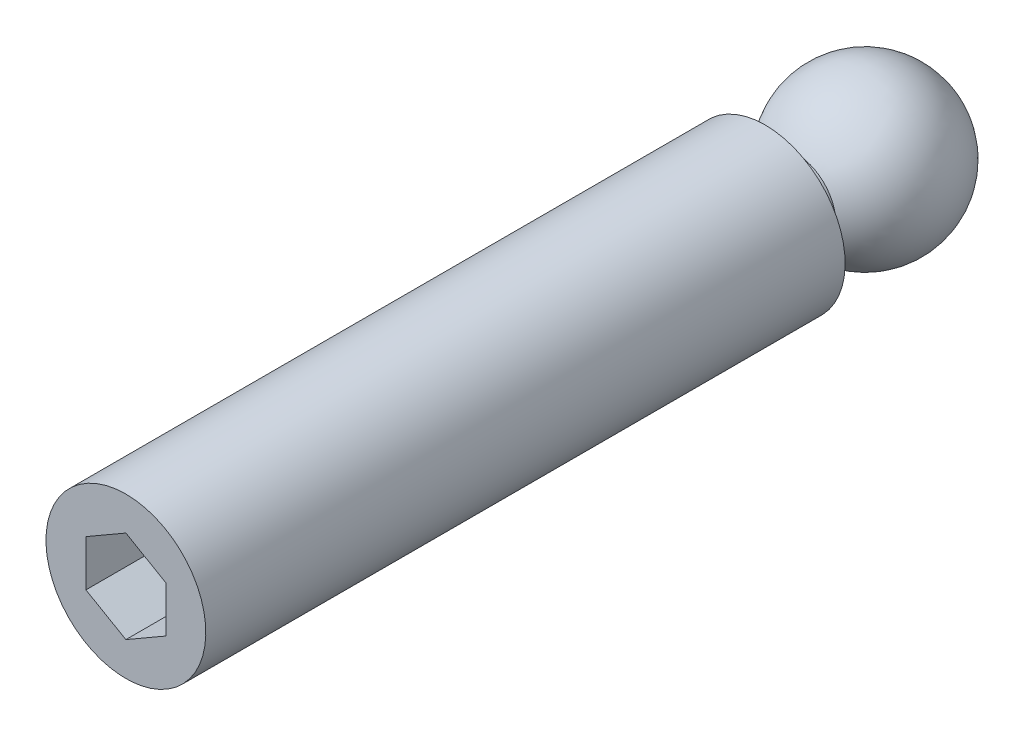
ISO-10303-21;
HEADER;
FILE_DESCRIPTION(('STEP AP214'),'2;1');
FILE_NAME('part.step','',(''),(''),'','','');
FILE_SCHEMA(('AUTOMOTIVE_DESIGN { 1 0 10303 214 1 1 1 1 }'));
ENDSEC;
DATA;
#1=APPLICATION_CONTEXT('core data for automotive mechanical design processes');
#2=APPLICATION_PROTOCOL_DEFINITION('international standard','automotive_design',2000,#1);
#3=PRODUCT_CONTEXT('',#1,'mechanical');
#4=PRODUCT('Part','Part','',(#3));
#5=PRODUCT_RELATED_PRODUCT_CATEGORY('part','',(#4));
#6=PRODUCT_DEFINITION_FORMATION('','',#4);
#7=PRODUCT_DEFINITION_CONTEXT('part definition',#1,'design');
#8=PRODUCT_DEFINITION('design','',#6,#7);
#9=PRODUCT_DEFINITION_SHAPE('','',#8);
#10=(LENGTH_UNIT() NAMED_UNIT(*) SI_UNIT(.MILLI.,.METRE.));
#11=(NAMED_UNIT(*) PLANE_ANGLE_UNIT() SI_UNIT($,.RADIAN.));
#12=(NAMED_UNIT(*) SI_UNIT($,.STERADIAN.) SOLID_ANGLE_UNIT());
#13=UNCERTAINTY_MEASURE_WITH_UNIT(LENGTH_MEASURE(1.E-05),#10,'distance_accuracy_value','');
#14=(GEOMETRIC_REPRESENTATION_CONTEXT(3) GLOBAL_UNCERTAINTY_ASSIGNED_CONTEXT((#13)) GLOBAL_UNIT_ASSIGNED_CONTEXT((#10,
#11,#12)) REPRESENTATION_CONTEXT('',''));
#15=CARTESIAN_POINT('',(0.,0.,0.));
#16=DIRECTION('',(0.,0.,1.));
#17=DIRECTION('',(1.,0.,0.));
#18=AXIS2_PLACEMENT_3D('',#15,#16,#17);
#19=CARTESIAN_POINT('',(0.,0.,4.));
#20=DIRECTION('',(0.,-1.,0.));
#21=DIRECTION('',(-1.,0.,0.));
#22=AXIS2_PLACEMENT_3D('',#19,#20,#21);
#23=SPHERICAL_SURFACE('',#22,4.);
#24=CARTESIAN_POINT('',(0.,0.,4.));
#25=DIRECTION('',(0.,0.,1.));
#26=DIRECTION('',(0.,1.,0.));
#27=AXIS2_PLACEMENT_3D('',#24,#25,#26);
#28=SPHERICAL_SURFACE('',#27,4.);
#29=CARTESIAN_POINT('',(0.,0.,7.46410161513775));
#30=DIRECTION('',(0.,0.,1.));
#31=DIRECTION('',(0.,1.,0.));
#32=AXIS2_PLACEMENT_3D('',#29,#30,#31);
#33=CIRCLE('',#32,2.);
#34=CARTESIAN_POINT('',(0.,2.,7.46410161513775));
#35=VERTEX_POINT('',#34);
#36=EDGE_CURVE('E9',#35,#35,#33,.T.);
#37=ORIENTED_EDGE('',*,*,#36,.F.);
#38=EDGE_LOOP('',(#37));
#39=FACE_BOUND('',#38,.T.);
#40=ADVANCED_FACE('F14',(#39),#28,.T.);
#41=CARTESIAN_POINT('',(0.,0.,30.));
#42=DIRECTION('',(0.,0.,1.));
#43=DIRECTION('',(0.,1.,0.));
#44=AXIS2_PLACEMENT_3D('',#41,#42,#43);
#45=CYLINDRICAL_SURFACE('',#44,2.);
#46=ORIENTED_EDGE('',*,*,#36,.T.);
#47=EDGE_LOOP('',(#46));
#48=FACE_BOUND('',#47,.T.);
#49=CARTESIAN_POINT('',(0.,0.,9.));
#50=DIRECTION('',(0.,0.,1.));
#51=DIRECTION('',(0.,1.,0.));
#52=AXIS2_PLACEMENT_3D('',#49,#50,#51);
#53=CIRCLE('',#52,2.);
#54=CARTESIAN_POINT('',(0.,2.,9.));
#55=VERTEX_POINT('',#54);
#56=EDGE_CURVE('E21',#55,#55,#53,.T.);
#57=ORIENTED_EDGE('',*,*,#56,.F.);
#58=EDGE_LOOP('',(#57));
#59=FACE_BOUND('',#58,.T.);
#60=ADVANCED_FACE('F131',(#48,#59),#45,.T.);
#61=CARTESIAN_POINT('',(0.,-4.,9.));
#62=DIRECTION('',(0.,0.,-1.));
#63=DIRECTION('',(0.,-1.,0.));
#64=AXIS2_PLACEMENT_3D('',#61,#62,#63);
#65=PLANE('',#64);
#66=ORIENTED_EDGE('',*,*,#56,.T.);
#67=EDGE_LOOP('',(#66));
#68=FACE_BOUND('',#67,.T.);
#69=CARTESIAN_POINT('',(0.,0.,9.));
#70=DIRECTION('',(0.,0.,1.));
#71=DIRECTION('',(0.,1.,0.));
#72=AXIS2_PLACEMENT_3D('',#69,#70,#71);
#73=CIRCLE('',#72,4.);
#74=CARTESIAN_POINT('',(0.,4.,9.));
#75=VERTEX_POINT('',#74);
#76=EDGE_CURVE('E123',#75,#75,#73,.T.);
#77=ORIENTED_EDGE('',*,*,#76,.F.);
#78=EDGE_LOOP('',(#77));
#79=FACE_BOUND('',#78,.T.);
#80=ADVANCED_FACE('F128',(#68,#79),#65,.T.);
#81=CARTESIAN_POINT('',(0.,0.,30.));
#82=DIRECTION('',(0.,0.,1.));
#83=DIRECTION('',(0.,1.,0.));
#84=AXIS2_PLACEMENT_3D('',#81,#82,#83);
#85=CYLINDRICAL_SURFACE('',#84,4.);
#86=ORIENTED_EDGE('',*,*,#76,.T.);
#87=EDGE_LOOP('',(#86));
#88=FACE_BOUND('',#87,.T.);
#89=CARTESIAN_POINT('',(0.,0.,41.));
#90=DIRECTION('',(0.,0.,1.));
#91=DIRECTION('',(0.,1.,0.));
#92=AXIS2_PLACEMENT_3D('',#89,#90,#91);
#93=CIRCLE('',#92,4.);
#94=CARTESIAN_POINT('',(0.,4.,41.));
#95=VERTEX_POINT('',#94);
#96=EDGE_CURVE('E115',#95,#95,#93,.T.);
#97=ORIENTED_EDGE('',*,*,#96,.F.);
#98=EDGE_LOOP('',(#97));
#99=FACE_BOUND('',#98,.T.);
#100=ADVANCED_FACE('F139',(#88,#99),#85,.T.);
#101=CARTESIAN_POINT('',(0.,0.,41.));
#102=DIRECTION('',(0.,0.,1.));
#103=DIRECTION('',(0.,1.,0.));
#104=AXIS2_PLACEMENT_3D('',#101,#102,#103);
#105=PLANE('',#104);
#106=DIRECTION('',(-0.866025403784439,0.5,0.));
#107=VECTOR('',#106,1.);
#108=CARTESIAN_POINT('',(2.,1.15470053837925,41.));
#109=LINE('',#108,#107);
#110=CARTESIAN_POINT('',(2.,1.15470053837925,41.));
#111=VERTEX_POINT('',#110);
#112=CARTESIAN_POINT('',(0.,2.30940107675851,41.));
#113=VERTEX_POINT('',#112);
#114=EDGE_CURVE('E28',#111,#113,#109,.T.);
#115=ORIENTED_EDGE('',*,*,#114,.F.);
#116=DIRECTION('',(0.,1.,0.));
#117=VECTOR('',#116,1.);
#118=CARTESIAN_POINT('',(2.,-1.15470053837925,41.));
#119=LINE('',#118,#117);
#120=CARTESIAN_POINT('',(2.,-1.15470053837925,41.));
#121=VERTEX_POINT('',#120);
#122=EDGE_CURVE('E111',#121,#111,#119,.T.);
#123=ORIENTED_EDGE('',*,*,#122,.F.);
#124=DIRECTION('',(0.866025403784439,0.5,0.));
#125=VECTOR('',#124,1.);
#126=CARTESIAN_POINT('',(0.,-2.30940107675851,41.));
#127=LINE('',#126,#125);
#128=CARTESIAN_POINT('',(0.,-2.30940107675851,41.));
#129=VERTEX_POINT('',#128);
#130=EDGE_CURVE('E109',#129,#121,#127,.T.);
#131=ORIENTED_EDGE('',*,*,#130,.F.);
#132=DIRECTION('',(0.866025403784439,-0.5,0.));
#133=VECTOR('',#132,1.);
#134=CARTESIAN_POINT('',(-2.,-1.15470053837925,41.));
#135=LINE('',#134,#133);
#136=CARTESIAN_POINT('',(-2.,-1.15470053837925,41.));
#137=VERTEX_POINT('',#136);
#138=EDGE_CURVE('E76',#137,#129,#135,.T.);
#139=ORIENTED_EDGE('',*,*,#138,.F.);
#140=DIRECTION('',(0.,-1.,0.));
#141=VECTOR('',#140,1.);
#142=CARTESIAN_POINT('',(-2.,1.15470053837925,41.));
#143=LINE('',#142,#141);
#144=CARTESIAN_POINT('',(-2.,1.15470053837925,41.));
#145=VERTEX_POINT('',#144);
#146=EDGE_CURVE('E105',#145,#137,#143,.T.);
#147=ORIENTED_EDGE('',*,*,#146,.F.);
#148=DIRECTION('',(-0.866025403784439,-0.5,0.));
#149=VECTOR('',#148,1.);
#150=CARTESIAN_POINT('',(0.,2.30940107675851,41.));
#151=LINE('',#150,#149);
#152=EDGE_CURVE('E102',#113,#145,#151,.T.);
#153=ORIENTED_EDGE('',*,*,#152,.F.);
#154=EDGE_LOOP('',(#115,#123,#131,#139,#147,#153));
#155=FACE_BOUND('',#154,.T.);
#156=ORIENTED_EDGE('',*,*,#96,.T.);
#157=EDGE_LOOP('',(#156));
#158=FACE_BOUND('',#157,.T.);
#159=ADVANCED_FACE('F145',(#155,#158),#105,.T.);
#160=CARTESIAN_POINT('',(2.,1.15470053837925,36.));
#161=DIRECTION('',(0.5,0.866025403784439,0.));
#162=DIRECTION('',(-0.866025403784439,0.5,0.));
#163=AXIS2_PLACEMENT_3D('',#160,#161,#162);
#164=PLANE('',#163);
#165=ORIENTED_EDGE('',*,*,#114,.T.);
#166=DIRECTION('',(0.,0.,1.));
#167=VECTOR('',#166,1.);
#168=CARTESIAN_POINT('',(0.,2.30940107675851,36.));
#169=LINE('',#168,#167);
#170=CARTESIAN_POINT('',(0.,2.30940107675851,36.));
#171=VERTEX_POINT('',#170);
#172=EDGE_CURVE('E58',#171,#113,#169,.T.);
#173=ORIENTED_EDGE('',*,*,#172,.F.);
#174=DIRECTION('',(-0.866025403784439,0.5,0.));
#175=VECTOR('',#174,1.);
#176=CARTESIAN_POINT('',(2.,1.15470053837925,36.));
#177=LINE('',#176,#175);
#178=CARTESIAN_POINT('',(2.,1.15470053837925,36.));
#179=VERTEX_POINT('',#178);
#180=EDGE_CURVE('E113',#179,#171,#177,.T.);
#181=ORIENTED_EDGE('',*,*,#180,.F.);
#182=DIRECTION('',(0.,0.,1.));
#183=VECTOR('',#182,1.);
#184=CARTESIAN_POINT('',(2.,1.15470053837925,36.));
#185=LINE('',#184,#183);
#186=EDGE_CURVE('E36',#179,#111,#185,.T.);
#187=ORIENTED_EDGE('',*,*,#186,.T.);
#188=EDGE_LOOP('',(#165,#173,#181,#187));
#189=FACE_BOUND('',#188,.T.);
#190=ADVANCED_FACE('F149',(#189),#164,.F.);
#191=CARTESIAN_POINT('',(2.,-1.15470053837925,36.));
#192=DIRECTION('',(1.,0.,0.));
#193=DIRECTION('',(0.,0.,-1.));
#194=AXIS2_PLACEMENT_3D('',#191,#192,#193);
#195=PLANE('',#194);
#196=ORIENTED_EDGE('',*,*,#122,.T.);
#197=ORIENTED_EDGE('',*,*,#186,.F.);
#198=DIRECTION('',(0.,1.,0.));
#199=VECTOR('',#198,1.);
#200=CARTESIAN_POINT('',(2.,-1.15470053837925,36.));
#201=LINE('',#200,#199);
#202=CARTESIAN_POINT('',(2.,-1.15470053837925,36.));
#203=VERTEX_POINT('',#202);
#204=EDGE_CURVE('E88',#203,#179,#201,.T.);
#205=ORIENTED_EDGE('',*,*,#204,.F.);
#206=DIRECTION('',(0.,0.,1.));
#207=VECTOR('',#206,1.);
#208=CARTESIAN_POINT('',(2.,-1.15470053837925,36.));
#209=LINE('',#208,#207);
#210=EDGE_CURVE('E80',#203,#121,#209,.T.);
#211=ORIENTED_EDGE('',*,*,#210,.T.);
#212=EDGE_LOOP('',(#196,#197,#205,#211));
#213=FACE_BOUND('',#212,.T.);
#214=ADVANCED_FACE('F153',(#213),#195,.F.);
#215=CARTESIAN_POINT('',(0.,-2.30940107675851,36.));
#216=DIRECTION('',(0.5,-0.866025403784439,0.));
#217=DIRECTION('',(0.866025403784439,0.5,0.));
#218=AXIS2_PLACEMENT_3D('',#215,#216,#217);
#219=PLANE('',#218);
#220=ORIENTED_EDGE('',*,*,#130,.T.);
#221=ORIENTED_EDGE('',*,*,#210,.F.);
#222=DIRECTION('',(0.866025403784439,0.5,0.));
#223=VECTOR('',#222,1.);
#224=CARTESIAN_POINT('',(0.,-2.30940107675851,36.));
#225=LINE('',#224,#223);
#226=CARTESIAN_POINT('',(0.,-2.30940107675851,36.));
#227=VERTEX_POINT('',#226);
#228=EDGE_CURVE('E84',#227,#203,#225,.T.);
#229=ORIENTED_EDGE('',*,*,#228,.F.);
#230=DIRECTION('',(0.,0.,1.));
#231=VECTOR('',#230,1.);
#232=CARTESIAN_POINT('',(0.,-2.30940107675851,36.));
#233=LINE('',#232,#231);
#234=EDGE_CURVE('E69',#227,#129,#233,.T.);
#235=ORIENTED_EDGE('',*,*,#234,.T.);
#236=EDGE_LOOP('',(#220,#221,#229,#235));
#237=FACE_BOUND('',#236,.T.);
#238=ADVANCED_FACE('F85',(#237),#219,.F.);
#239=CARTESIAN_POINT('',(-2.,-1.15470053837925,36.));
#240=DIRECTION('',(-0.5,-0.866025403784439,0.));
#241=DIRECTION('',(0.866025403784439,-0.5,0.));
#242=AXIS2_PLACEMENT_3D('',#239,#240,#241);
#243=PLANE('',#242);
#244=ORIENTED_EDGE('',*,*,#138,.T.);
#245=ORIENTED_EDGE('',*,*,#234,.F.);
#246=DIRECTION('',(0.866025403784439,-0.5,0.));
#247=VECTOR('',#246,1.);
#248=CARTESIAN_POINT('',(-2.,-1.15470053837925,36.));
#249=LINE('',#248,#247);
#250=CARTESIAN_POINT('',(-2.,-1.15470053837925,36.));
#251=VERTEX_POINT('',#250);
#252=EDGE_CURVE('E73',#251,#227,#249,.T.);
#253=ORIENTED_EDGE('',*,*,#252,.F.);
#254=DIRECTION('',(0.,0.,1.));
#255=VECTOR('',#254,1.);
#256=CARTESIAN_POINT('',(-2.,-1.15470053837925,36.));
#257=LINE('',#256,#255);
#258=EDGE_CURVE('E81',#251,#137,#257,.T.);
#259=ORIENTED_EDGE('',*,*,#258,.T.);
#260=EDGE_LOOP('',(#244,#245,#253,#259));
#261=FACE_BOUND('',#260,.T.);
#262=ADVANCED_FACE('F71',(#261),#243,.F.);
#263=CARTESIAN_POINT('',(-2.,1.15470053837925,36.));
#264=DIRECTION('',(-1.,0.,0.));
#265=DIRECTION('',(0.,0.,1.));
#266=AXIS2_PLACEMENT_3D('',#263,#264,#265);
#267=PLANE('',#266);
#268=ORIENTED_EDGE('',*,*,#146,.T.);
#269=ORIENTED_EDGE('',*,*,#258,.F.);
#270=DIRECTION('',(0.,-1.,0.));
#271=VECTOR('',#270,1.);
#272=CARTESIAN_POINT('',(-2.,1.15470053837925,36.));
#273=LINE('',#272,#271);
#274=CARTESIAN_POINT('',(-2.,1.15470053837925,36.));
#275=VERTEX_POINT('',#274);
#276=EDGE_CURVE('E94',#275,#251,#273,.T.);
#277=ORIENTED_EDGE('',*,*,#276,.F.);
#278=DIRECTION('',(0.,0.,1.));
#279=VECTOR('',#278,1.);
#280=CARTESIAN_POINT('',(-2.,1.15470053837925,36.));
#281=LINE('',#280,#279);
#282=EDGE_CURVE('E118',#275,#145,#281,.T.);
#283=ORIENTED_EDGE('',*,*,#282,.T.);
#284=EDGE_LOOP('',(#268,#269,#277,#283));
#285=FACE_BOUND('',#284,.T.);
#286=ADVANCED_FACE('F157',(#285),#267,.F.);
#287=CARTESIAN_POINT('',(0.,2.30940107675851,36.));
#288=DIRECTION('',(-0.5,0.866025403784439,0.));
#289=DIRECTION('',(-0.866025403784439,-0.5,0.));
#290=AXIS2_PLACEMENT_3D('',#287,#288,#289);
#291=PLANE('',#290);
#292=ORIENTED_EDGE('',*,*,#152,.T.);
#293=ORIENTED_EDGE('',*,*,#282,.F.);
#294=DIRECTION('',(-0.866025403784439,-0.5,0.));
#295=VECTOR('',#294,1.);
#296=CARTESIAN_POINT('',(0.,2.30940107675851,36.));
#297=LINE('',#296,#295);
#298=EDGE_CURVE('E96',#171,#275,#297,.T.);
#299=ORIENTED_EDGE('',*,*,#298,.F.);
#300=ORIENTED_EDGE('',*,*,#172,.T.);
#301=EDGE_LOOP('',(#292,#293,#299,#300));
#302=FACE_BOUND('',#301,.T.);
#303=ADVANCED_FACE('F154',(#302),#291,.F.);
#304=CARTESIAN_POINT('',(0.,2.30940107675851,36.));
#305=DIRECTION('',(0.,0.,1.));
#306=DIRECTION('',(1.,0.,0.));
#307=AXIS2_PLACEMENT_3D('',#304,#305,#306);
#308=PLANE('',#307);
#309=ORIENTED_EDGE('',*,*,#180,.T.);
#310=ORIENTED_EDGE('',*,*,#298,.T.);
#311=ORIENTED_EDGE('',*,*,#276,.T.);
#312=ORIENTED_EDGE('',*,*,#252,.T.);
#313=ORIENTED_EDGE('',*,*,#228,.T.);
#314=ORIENTED_EDGE('',*,*,#204,.T.);
#315=EDGE_LOOP('',(#309,#310,#311,#312,#313,#314));
#316=FACE_BOUND('',#315,.T.);
#317=ADVANCED_FACE('F91',(#316),#308,.T.);
#318=CLOSED_SHELL('',(#40,#60,#80,#100,#159,#190,#214,#238,#262,#286,#303,#317));
#319=MANIFOLD_SOLID_BREP('B1',#318);
#320=ADVANCED_BREP_SHAPE_REPRESENTATION('',(#18,#319),#14);
#321=SHAPE_DEFINITION_REPRESENTATION(#9,#320);
ENDSEC;
END-ISO-10303-21;
